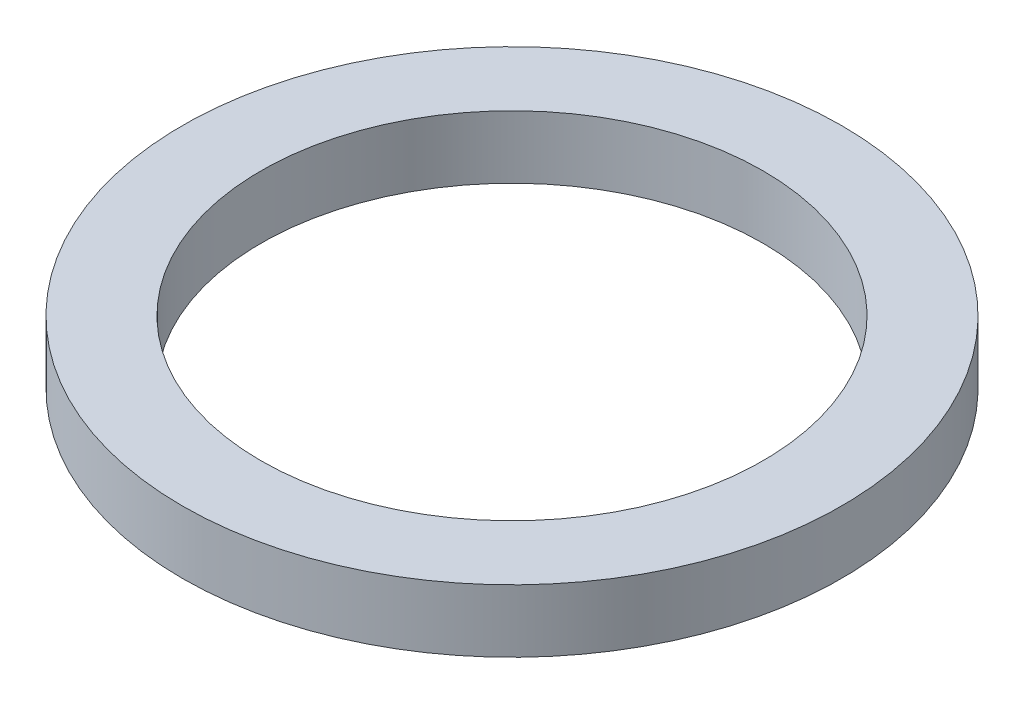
from build123d import *

# Parameters (mm, degrees)
ESQUISSE1_R          = 4.2
ESQUISSE1_R_2        = 3.2
BASE_EXTRUSION_DEPTH = 0.8


with BuildPart() as part:
    # Esquisse1 → Base-Extrusion (new body)
    with BuildSketch(Plane(origin=(0, 0.8, 0), x_dir=(-1, 0, 0), z_dir=(0, 1, 0))):
        with Locations(Location((-21.8, 0, 0), (0, 0, 270))):
            Circle(ESQUISSE1_R)
        with Locations(Location((-21.8, 0, 0), (0, 0, 270))):
            Circle(ESQUISSE1_R_2, mode=Mode.SUBTRACT)
    extrude(amount=-BASE_EXTRUSION_DEPTH)


solid = part.part
